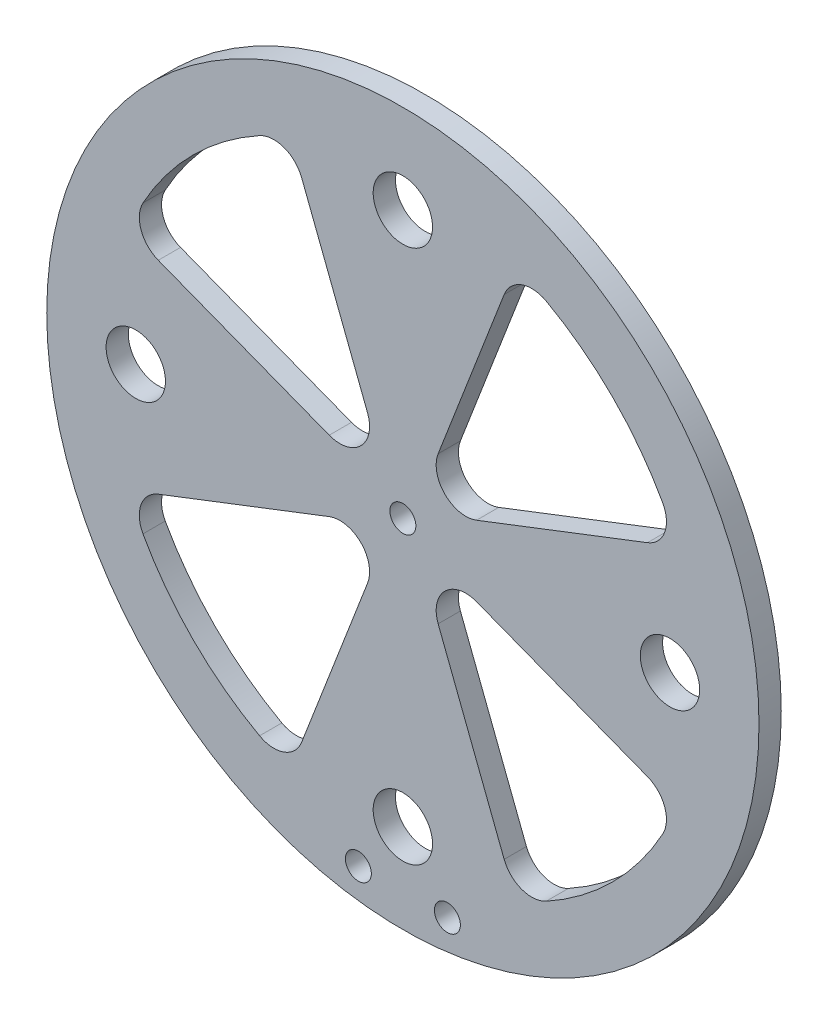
ISO-10303-21;
HEADER;
FILE_DESCRIPTION(('STEP AP214'),'2;1');
FILE_NAME('part.step','',(''),(''),'','','');
FILE_SCHEMA(('AUTOMOTIVE_DESIGN { 1 0 10303 214 1 1 1 1 }'));
ENDSEC;
DATA;
#1=APPLICATION_CONTEXT('core data for automotive mechanical design processes');
#2=APPLICATION_PROTOCOL_DEFINITION('international standard','automotive_design',2000,#1);
#3=PRODUCT_CONTEXT('',#1,'mechanical');
#4=PRODUCT('Part','Part','',(#3));
#5=PRODUCT_RELATED_PRODUCT_CATEGORY('part','',(#4));
#6=PRODUCT_DEFINITION_FORMATION('','',#4);
#7=PRODUCT_DEFINITION_CONTEXT('part definition',#1,'design');
#8=PRODUCT_DEFINITION('design','',#6,#7);
#9=PRODUCT_DEFINITION_SHAPE('','',#8);
#10=(LENGTH_UNIT() NAMED_UNIT(*) SI_UNIT(.MILLI.,.METRE.));
#11=(NAMED_UNIT(*) PLANE_ANGLE_UNIT() SI_UNIT($,.RADIAN.));
#12=(NAMED_UNIT(*) SI_UNIT($,.STERADIAN.) SOLID_ANGLE_UNIT());
#13=UNCERTAINTY_MEASURE_WITH_UNIT(LENGTH_MEASURE(1.E-05),#10,'distance_accuracy_value','');
#14=(GEOMETRIC_REPRESENTATION_CONTEXT(3) GLOBAL_UNCERTAINTY_ASSIGNED_CONTEXT((#13)) GLOBAL_UNIT_ASSIGNED_CONTEXT((#10,
#11,#12)) REPRESENTATION_CONTEXT('',''));
#15=CARTESIAN_POINT('',(0.,0.,0.));
#16=DIRECTION('',(0.,0.,1.));
#17=DIRECTION('',(1.,0.,0.));
#18=AXIS2_PLACEMENT_3D('',#15,#16,#17);
#19=CARTESIAN_POINT('',(0.,0.,3.));
#20=DIRECTION('',(0.,0.,1.));
#21=DIRECTION('',(1.,0.,0.));
#22=AXIS2_PLACEMENT_3D('',#19,#20,#21);
#23=PLANE('',#22);
#24=CARTESIAN_POINT('',(6.,-43.5889894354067,3.));
#25=DIRECTION('',(0.,0.,1.));
#26=DIRECTION('',(1.,0.,0.));
#27=AXIS2_PLACEMENT_3D('',#24,#25,#26);
#28=CIRCLE('',#27,1.75);
#29=CARTESIAN_POINT('',(7.75,-43.5889894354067,3.));
#30=VERTEX_POINT('',#29);
#31=EDGE_CURVE('E236',#30,#30,#28,.T.);
#32=ORIENTED_EDGE('',*,*,#31,.F.);
#33=EDGE_LOOP('',(#32));
#34=FACE_BOUND('',#33,.T.);
#35=CARTESIAN_POINT('',(-17.3829707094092,-31.5251063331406,3.));
#36=DIRECTION('',(0.,0.,1.));
#37=DIRECTION('',(1.,0.,0.));
#38=AXIS2_PLACEMENT_3D('',#35,#36,#37);
#39=CIRCLE('',#38,3.99999999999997);
#40=CARTESIAN_POINT('',(-19.3144118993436,-35.0278959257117,3.));
#41=VERTEX_POINT('',#40);
#42=CARTESIAN_POINT('',(-13.6515570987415,-32.966131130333,3.));
#43=VERTEX_POINT('',#42);
#44=EDGE_CURVE('E258',#41,#43,#39,.T.);
#45=ORIENTED_EDGE('',*,*,#44,.F.);
#46=CARTESIAN_POINT('',(0.,0.,3.));
#47=DIRECTION('',(0.,0.,1.));
#48=DIRECTION('',(1.,0.,0.));
#49=AXIS2_PLACEMENT_3D('',#46,#47,#48);
#50=CIRCLE('',#49,40.);
#51=CARTESIAN_POINT('',(-35.0278959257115,-19.3144118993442,3.));
#52=VERTEX_POINT('',#51);
#53=EDGE_CURVE('E256',#52,#41,#50,.T.);
#54=ORIENTED_EDGE('',*,*,#53,.F.);
#55=CARTESIAN_POINT('',(-31.5251063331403,-17.3829707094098,3.));
#56=DIRECTION('',(0.,0.,1.));
#57=DIRECTION('',(1.,0.,0.));
#58=AXIS2_PLACEMENT_3D('',#55,#56,#57);
#59=CIRCLE('',#58,4.00000000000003);
#60=CARTESIAN_POINT('',(-32.9661311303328,-13.651557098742,3.));
#61=VERTEX_POINT('',#60);
#62=EDGE_CURVE('E268',#61,#52,#59,.T.);
#63=ORIENTED_EDGE('',*,*,#62,.F.);
#64=DIRECTION('',(-0.932853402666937,-0.360256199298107,0.));
#65=VECTOR('',#64,1.);
#66=CARTESIAN_POINT('',(-9.92630617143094,-4.75386776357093,3.));
#67=LINE('',#66,#65);
#68=CARTESIAN_POINT('',(-9.92630617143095,-4.7538677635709,3.));
#69=VERTEX_POINT('',#68);
#70=EDGE_CURVE('E265',#69,#61,#67,.T.);
#71=ORIENTED_EDGE('',*,*,#70,.F.);
#72=CARTESIAN_POINT('',(-8.48528137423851,-8.48528137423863,3.));
#73=DIRECTION('',(0.,0.,1.));
#74=DIRECTION('',(1.,0.,0.));
#75=AXIS2_PLACEMENT_3D('',#72,#73,#74);
#76=CIRCLE('',#75,3.99999999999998);
#77=CARTESIAN_POINT('',(-4.75386776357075,-9.92630617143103,3.));
#78=VERTEX_POINT('',#77);
#79=EDGE_CURVE('E263',#78,#69,#76,.T.);
#80=ORIENTED_EDGE('',*,*,#79,.F.);
#81=DIRECTION('',(0.360256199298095,0.932853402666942,0.));
#82=VECTOR('',#81,1.);
#83=CARTESIAN_POINT('',(-4.75386776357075,-9.92630617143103,3.));
#84=LINE('',#83,#82);
#85=EDGE_CURVE('E261',#43,#78,#84,.T.);
#86=ORIENTED_EDGE('',*,*,#85,.F.);
#87=EDGE_LOOP('',(#45,#54,#63,#71,#80,#86));
#88=FACE_BOUND('',#87,.T.);
#89=CARTESIAN_POINT('',(17.3829707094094,31.5251063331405,3.));
#90=DIRECTION('',(0.,0.,1.));
#91=DIRECTION('',(1.,0.,0.));
#92=AXIS2_PLACEMENT_3D('',#89,#90,#91);
#93=CIRCLE('',#92,3.99999999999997);
#94=CARTESIAN_POINT('',(19.3144118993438,35.0278959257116,3.));
#95=VERTEX_POINT('',#94);
#96=CARTESIAN_POINT('',(13.6515570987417,32.9661311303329,3.));
#97=VERTEX_POINT('',#96);
#98=EDGE_CURVE('E348',#95,#97,#93,.T.);
#99=ORIENTED_EDGE('',*,*,#98,.F.);
#100=CARTESIAN_POINT('',(0.,0.,3.));
#101=DIRECTION('',(0.,0.,1.));
#102=DIRECTION('',(1.,0.,0.));
#103=AXIS2_PLACEMENT_3D('',#100,#101,#102);
#104=CIRCLE('',#103,40.);
#105=CARTESIAN_POINT('',(35.0278959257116,19.314411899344,3.));
#106=VERTEX_POINT('',#105);
#107=EDGE_CURVE('E346',#106,#95,#104,.T.);
#108=ORIENTED_EDGE('',*,*,#107,.F.);
#109=CARTESIAN_POINT('',(31.5251063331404,17.3829707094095,3.));
#110=DIRECTION('',(0.,0.,1.));
#111=DIRECTION('',(1.,0.,0.));
#112=AXIS2_PLACEMENT_3D('',#109,#110,#111);
#113=CIRCLE('',#112,4.00000000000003);
#114=CARTESIAN_POINT('',(32.9661311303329,13.6515570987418,3.));
#115=VERTEX_POINT('',#114);
#116=EDGE_CURVE('E358',#115,#106,#113,.T.);
#117=ORIENTED_EDGE('',*,*,#116,.F.);
#118=DIRECTION('',(0.93285340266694,0.3602561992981,0.));
#119=VECTOR('',#118,1.);
#120=CARTESIAN_POINT('',(9.92630617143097,4.75386776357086,3.));
#121=LINE('',#120,#119);
#122=CARTESIAN_POINT('',(9.92630617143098,4.75386776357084,3.));
#123=VERTEX_POINT('',#122);
#124=EDGE_CURVE('E355',#123,#115,#121,.T.);
#125=ORIENTED_EDGE('',*,*,#124,.F.);
#126=CARTESIAN_POINT('',(8.48528137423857,8.48528137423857,3.));
#127=DIRECTION('',(0.,0.,1.));
#128=DIRECTION('',(1.,0.,0.));
#129=AXIS2_PLACEMENT_3D('',#126,#127,#128);
#130=CIRCLE('',#129,3.99999999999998);
#131=CARTESIAN_POINT('',(4.75386776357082,9.92630617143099,3.));
#132=VERTEX_POINT('',#131);
#133=EDGE_CURVE('E353',#132,#123,#130,.T.);
#134=ORIENTED_EDGE('',*,*,#133,.F.);
#135=DIRECTION('',(-0.360256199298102,-0.932853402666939,0.));
#136=VECTOR('',#135,1.);
#137=CARTESIAN_POINT('',(4.75386776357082,9.92630617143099,3.));
#138=LINE('',#137,#136);
#139=EDGE_CURVE('E351',#97,#132,#138,.T.);
#140=ORIENTED_EDGE('',*,*,#139,.F.);
#141=EDGE_LOOP('',(#99,#108,#117,#125,#134,#140));
#142=FACE_BOUND('',#141,.T.);
#143=CARTESIAN_POINT('',(-36.,3.77080202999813E-13,3.));
#144=DIRECTION('',(0.,0.,1.));
#145=DIRECTION('',(1.,0.,0.));
#146=AXIS2_PLACEMENT_3D('',#143,#144,#145);
#147=CIRCLE('',#146,4.);
#148=CARTESIAN_POINT('',(-32.,3.77080202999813E-13,3.));
#149=VERTEX_POINT('',#148);
#150=EDGE_CURVE('E397',#149,#149,#147,.T.);
#151=ORIENTED_EDGE('',*,*,#150,.F.);
#152=EDGE_LOOP('',(#151));
#153=FACE_BOUND('',#152,.T.);
#154=CARTESIAN_POINT('',(36.,-1.25693400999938E-13,3.));
#155=DIRECTION('',(0.,0.,1.));
#156=DIRECTION('',(1.,0.,0.));
#157=AXIS2_PLACEMENT_3D('',#154,#155,#156);
#158=CIRCLE('',#157,4.);
#159=CARTESIAN_POINT('',(40.,-1.25693400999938E-13,3.));
#160=VERTEX_POINT('',#159);
#161=EDGE_CURVE('E409',#160,#160,#158,.T.);
#162=ORIENTED_EDGE('',*,*,#161,.F.);
#163=EDGE_LOOP('',(#162));
#164=FACE_BOUND('',#163,.T.);
#165=CARTESIAN_POINT('',(0.,0.,3.));
#166=DIRECTION('',(0.,0.,1.));
#167=DIRECTION('',(1.,0.,0.));
#168=AXIS2_PLACEMENT_3D('',#165,#166,#167);
#169=CIRCLE('',#168,48.);
#170=CARTESIAN_POINT('',(48.,0.,3.));
#171=VERTEX_POINT('',#170);
#172=EDGE_CURVE('E13',#171,#171,#169,.T.);
#173=ORIENTED_EDGE('',*,*,#172,.T.);
#174=EDGE_LOOP('',(#173));
#175=FACE_BOUND('',#174,.T.);
#176=CARTESIAN_POINT('',(0.,36.,3.));
#177=DIRECTION('',(0.,0.,1.));
#178=DIRECTION('',(1.,0.,0.));
#179=AXIS2_PLACEMENT_3D('',#176,#177,#178);
#180=CIRCLE('',#179,4.);
#181=CARTESIAN_POINT('',(4.,36.,3.));
#182=VERTEX_POINT('',#181);
#183=EDGE_CURVE('E415',#182,#182,#180,.T.);
#184=ORIENTED_EDGE('',*,*,#183,.F.);
#185=EDGE_LOOP('',(#184));
#186=FACE_BOUND('',#185,.T.);
#187=CARTESIAN_POINT('',(-2.51386801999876E-13,-36.,3.));
#188=DIRECTION('',(0.,0.,1.));
#189=DIRECTION('',(1.,0.,0.));
#190=AXIS2_PLACEMENT_3D('',#187,#188,#189);
#191=CIRCLE('',#190,4.);
#192=CARTESIAN_POINT('',(3.99999999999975,-36.,3.));
#193=VERTEX_POINT('',#192);
#194=EDGE_CURVE('E403',#193,#193,#191,.T.);
#195=ORIENTED_EDGE('',*,*,#194,.F.);
#196=EDGE_LOOP('',(#195));
#197=FACE_BOUND('',#196,.T.);
#198=CARTESIAN_POINT('',(0.,0.,3.));
#199=DIRECTION('',(0.,0.,1.));
#200=DIRECTION('',(1.,0.,0.));
#201=AXIS2_PLACEMENT_3D('',#198,#199,#200);
#202=CIRCLE('',#201,1.75);
#203=CARTESIAN_POINT('',(1.75,0.,3.));
#204=VERTEX_POINT('',#203);
#205=EDGE_CURVE('E391',#204,#204,#202,.T.);
#206=ORIENTED_EDGE('',*,*,#205,.F.);
#207=EDGE_LOOP('',(#206));
#208=FACE_BOUND('',#207,.T.);
#209=CARTESIAN_POINT('',(-31.5251063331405,17.3829707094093,3.));
#210=DIRECTION('',(0.,0.,1.));
#211=DIRECTION('',(1.,0.,0.));
#212=AXIS2_PLACEMENT_3D('',#209,#210,#211);
#213=CIRCLE('',#212,3.99999999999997);
#214=CARTESIAN_POINT('',(-35.0278959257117,19.3144118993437,3.));
#215=VERTEX_POINT('',#214);
#216=CARTESIAN_POINT('',(-32.9661311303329,13.6515570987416,3.));
#217=VERTEX_POINT('',#216);
#218=EDGE_CURVE('E303',#215,#217,#213,.T.);
#219=ORIENTED_EDGE('',*,*,#218,.F.);
#220=CARTESIAN_POINT('',(0.,0.,3.));
#221=DIRECTION('',(0.,0.,1.));
#222=DIRECTION('',(1.,0.,0.));
#223=AXIS2_PLACEMENT_3D('',#220,#221,#222);
#224=CIRCLE('',#223,40.);
#225=CARTESIAN_POINT('',(-19.3144118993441,35.0278959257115,3.));
#226=VERTEX_POINT('',#225);
#227=EDGE_CURVE('E301',#226,#215,#224,.T.);
#228=ORIENTED_EDGE('',*,*,#227,.F.);
#229=CARTESIAN_POINT('',(-17.3829707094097,31.5251063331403,3.));
#230=DIRECTION('',(0.,0.,1.));
#231=DIRECTION('',(1.,0.,0.));
#232=AXIS2_PLACEMENT_3D('',#229,#230,#231);
#233=CIRCLE('',#232,4.00000000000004);
#234=CARTESIAN_POINT('',(-13.6515570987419,32.9661311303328,3.));
#235=VERTEX_POINT('',#234);
#236=EDGE_CURVE('E313',#235,#226,#233,.T.);
#237=ORIENTED_EDGE('',*,*,#236,.F.);
#238=DIRECTION('',(-0.360256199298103,0.932853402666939,0.));
#239=VECTOR('',#238,1.);
#240=CARTESIAN_POINT('',(-4.75386776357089,9.92630617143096,3.));
#241=LINE('',#240,#239);
#242=CARTESIAN_POINT('',(-4.75386776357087,9.92630617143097,3.));
#243=VERTEX_POINT('',#242);
#244=EDGE_CURVE('E310',#243,#235,#241,.T.);
#245=ORIENTED_EDGE('',*,*,#244,.F.);
#246=CARTESIAN_POINT('',(-8.4852813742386,8.48528137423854,3.));
#247=DIRECTION('',(0.,0.,1.));
#248=DIRECTION('',(1.,0.,0.));
#249=AXIS2_PLACEMENT_3D('',#246,#247,#248);
#250=CIRCLE('',#249,3.99999999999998);
#251=CARTESIAN_POINT('',(-9.92630617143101,4.75386776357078,3.));
#252=VERTEX_POINT('',#251);
#253=EDGE_CURVE('E308',#252,#243,#250,.T.);
#254=ORIENTED_EDGE('',*,*,#253,.F.);
#255=DIRECTION('',(0.93285340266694,-0.360256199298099,0.));
#256=VECTOR('',#255,1.);
#257=CARTESIAN_POINT('',(-9.92630617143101,4.75386776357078,3.));
#258=LINE('',#257,#256);
#259=EDGE_CURVE('E306',#217,#252,#258,.T.);
#260=ORIENTED_EDGE('',*,*,#259,.F.);
#261=EDGE_LOOP('',(#219,#228,#237,#245,#254,#260));
#262=FACE_BOUND('',#261,.T.);
#263=CARTESIAN_POINT('',(31.5251063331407,-17.3829707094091,3.));
#264=DIRECTION('',(0.,0.,1.));
#265=DIRECTION('',(1.,0.,0.));
#266=AXIS2_PLACEMENT_3D('',#263,#264,#265);
#267=CIRCLE('',#266,3.99999999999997);
#268=CARTESIAN_POINT('',(35.0278959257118,-19.3144118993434,3.));
#269=VERTEX_POINT('',#268);
#270=CARTESIAN_POINT('',(32.966131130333,-13.6515570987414,3.));
#271=VERTEX_POINT('',#270);
#272=EDGE_CURVE('E210',#269,#271,#267,.T.);
#273=ORIENTED_EDGE('',*,*,#272,.F.);
#274=CARTESIAN_POINT('',(0.,0.,3.));
#275=DIRECTION('',(0.,0.,1.));
#276=DIRECTION('',(1.,0.,0.));
#277=AXIS2_PLACEMENT_3D('',#274,#275,#276);
#278=CIRCLE('',#277,40.);
#279=CARTESIAN_POINT('',(19.3144118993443,-35.0278959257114,3.));
#280=VERTEX_POINT('',#279);
#281=EDGE_CURVE('E202',#280,#269,#278,.T.);
#282=ORIENTED_EDGE('',*,*,#281,.F.);
#283=CARTESIAN_POINT('',(17.3829707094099,-31.5251063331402,3.));
#284=DIRECTION('',(0.,0.,1.));
#285=DIRECTION('',(1.,0.,0.));
#286=AXIS2_PLACEMENT_3D('',#283,#284,#285);
#287=CIRCLE('',#286,4.00000000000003);
#288=CARTESIAN_POINT('',(13.6515570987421,-32.9661311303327,3.));
#289=VERTEX_POINT('',#288);
#290=EDGE_CURVE('E233',#289,#280,#287,.T.);
#291=ORIENTED_EDGE('',*,*,#290,.F.);
#292=DIRECTION('',(0.36025619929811,-0.932853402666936,0.));
#293=VECTOR('',#292,1.);
#294=CARTESIAN_POINT('',(4.75386776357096,-9.92630617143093,3.));
#295=LINE('',#294,#293);
#296=CARTESIAN_POINT('',(4.75386776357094,-9.92630617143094,3.));
#297=VERTEX_POINT('',#296);
#298=EDGE_CURVE('E231',#297,#289,#295,.T.);
#299=ORIENTED_EDGE('',*,*,#298,.F.);
#300=CARTESIAN_POINT('',(8.48528137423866,-8.48528137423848,3.));
#301=DIRECTION('',(0.,0.,1.));
#302=DIRECTION('',(1.,0.,0.));
#303=AXIS2_PLACEMENT_3D('',#300,#301,#302);
#304=CIRCLE('',#303,3.99999999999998);
#305=CARTESIAN_POINT('',(9.92630617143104,-4.75386776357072,3.));
#306=VERTEX_POINT('',#305);
#307=EDGE_CURVE('E226',#306,#297,#304,.T.);
#308=ORIENTED_EDGE('',*,*,#307,.F.);
#309=DIRECTION('',(-0.932853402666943,0.360256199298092,0.));
#310=VECTOR('',#309,1.);
#311=CARTESIAN_POINT('',(9.92630617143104,-4.75386776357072,3.));
#312=LINE('',#311,#310);
#313=EDGE_CURVE('E224',#271,#306,#312,.T.);
#314=ORIENTED_EDGE('',*,*,#313,.F.);
#315=EDGE_LOOP('',(#273,#282,#291,#299,#308,#314));
#316=FACE_BOUND('',#315,.T.);
#317=CARTESIAN_POINT('',(-6.,-43.5889894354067,3.));
#318=DIRECTION('',(0.,0.,1.));
#319=DIRECTION('',(1.,0.,0.));
#320=AXIS2_PLACEMENT_3D('',#317,#318,#319);
#321=CIRCLE('',#320,1.75);
#322=CARTESIAN_POINT('',(-4.25,-43.5889894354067,3.));
#323=VERTEX_POINT('',#322);
#324=EDGE_CURVE('E756',#323,#323,#321,.T.);
#325=ORIENTED_EDGE('',*,*,#324,.F.);
#326=EDGE_LOOP('',(#325));
#327=FACE_BOUND('',#326,.T.);
#328=ADVANCED_FACE('F41',(#34,#88,#142,#153,#164,#175,#186,#197,#208,#262,#316,#327),#23,.T.);
#329=CARTESIAN_POINT('',(0.,0.,0.));
#330=DIRECTION('',(0.,0.,1.));
#331=DIRECTION('',(1.,0.,0.));
#332=AXIS2_PLACEMENT_3D('',#329,#330,#331);
#333=PLANE('',#332);
#334=CARTESIAN_POINT('',(6.,-43.5889894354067,0.));
#335=DIRECTION('',(0.,0.,1.));
#336=DIRECTION('',(1.,0.,0.));
#337=AXIS2_PLACEMENT_3D('',#334,#335,#336);
#338=CIRCLE('',#337,1.75);
#339=CARTESIAN_POINT('',(7.75,-43.5889894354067,0.));
#340=VERTEX_POINT('',#339);
#341=EDGE_CURVE('E762',#340,#340,#338,.T.);
#342=ORIENTED_EDGE('',*,*,#341,.T.);
#343=EDGE_LOOP('',(#342));
#344=FACE_BOUND('',#343,.T.);
#345=CARTESIAN_POINT('',(0.,0.,0.));
#346=DIRECTION('',(0.,0.,1.));
#347=DIRECTION('',(1.,0.,0.));
#348=AXIS2_PLACEMENT_3D('',#345,#346,#347);
#349=CIRCLE('',#348,40.);
#350=CARTESIAN_POINT('',(-35.0278959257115,-19.3144118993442,0.));
#351=VERTEX_POINT('',#350);
#352=CARTESIAN_POINT('',(-19.3144118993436,-35.0278959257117,0.));
#353=VERTEX_POINT('',#352);
#354=EDGE_CURVE('E218',#351,#353,#349,.T.);
#355=ORIENTED_EDGE('',*,*,#354,.T.);
#356=CARTESIAN_POINT('',(-17.3829707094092,-31.5251063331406,0.));
#357=DIRECTION('',(0.,0.,1.));
#358=DIRECTION('',(1.,0.,0.));
#359=AXIS2_PLACEMENT_3D('',#356,#357,#358);
#360=CIRCLE('',#359,3.99999999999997);
#361=CARTESIAN_POINT('',(-13.6515570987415,-32.966131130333,0.));
#362=VERTEX_POINT('',#361);
#363=EDGE_CURVE('E273',#353,#362,#360,.T.);
#364=ORIENTED_EDGE('',*,*,#363,.T.);
#365=DIRECTION('',(0.360256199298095,0.932853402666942,0.));
#366=VECTOR('',#365,1.);
#367=CARTESIAN_POINT('',(-4.75386776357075,-9.92630617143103,0.));
#368=LINE('',#367,#366);
#369=CARTESIAN_POINT('',(-4.75386776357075,-9.92630617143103,0.));
#370=VERTEX_POINT('',#369);
#371=EDGE_CURVE('E276',#362,#370,#368,.T.);
#372=ORIENTED_EDGE('',*,*,#371,.T.);
#373=CARTESIAN_POINT('',(-8.48528137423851,-8.48528137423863,0.));
#374=DIRECTION('',(0.,0.,1.));
#375=DIRECTION('',(1.,0.,0.));
#376=AXIS2_PLACEMENT_3D('',#373,#374,#375);
#377=CIRCLE('',#376,3.99999999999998);
#378=CARTESIAN_POINT('',(-9.92630617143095,-4.7538677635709,0.));
#379=VERTEX_POINT('',#378);
#380=EDGE_CURVE('E279',#370,#379,#377,.T.);
#381=ORIENTED_EDGE('',*,*,#380,.T.);
#382=DIRECTION('',(-0.932853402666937,-0.360256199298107,0.));
#383=VECTOR('',#382,1.);
#384=CARTESIAN_POINT('',(-9.92630617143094,-4.75386776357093,0.));
#385=LINE('',#384,#383);
#386=CARTESIAN_POINT('',(-32.9661311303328,-13.651557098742,0.));
#387=VERTEX_POINT('',#386);
#388=EDGE_CURVE('E282',#379,#387,#385,.T.);
#389=ORIENTED_EDGE('',*,*,#388,.T.);
#390=CARTESIAN_POINT('',(-31.5251063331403,-17.3829707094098,0.));
#391=DIRECTION('',(0.,0.,1.));
#392=DIRECTION('',(1.,0.,0.));
#393=AXIS2_PLACEMENT_3D('',#390,#391,#392);
#394=CIRCLE('',#393,4.00000000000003);
#395=EDGE_CURVE('E259',#387,#351,#394,.T.);
#396=ORIENTED_EDGE('',*,*,#395,.T.);
#397=EDGE_LOOP('',(#355,#364,#372,#381,#389,#396));
#398=FACE_BOUND('',#397,.T.);
#399=CARTESIAN_POINT('',(0.,0.,0.));
#400=DIRECTION('',(0.,0.,1.));
#401=DIRECTION('',(1.,0.,0.));
#402=AXIS2_PLACEMENT_3D('',#399,#400,#401);
#403=CIRCLE('',#402,40.);
#404=CARTESIAN_POINT('',(35.0278959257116,19.314411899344,0.));
#405=VERTEX_POINT('',#404);
#406=CARTESIAN_POINT('',(19.3144118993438,35.0278959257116,0.));
#407=VERTEX_POINT('',#406);
#408=EDGE_CURVE('E345',#405,#407,#403,.T.);
#409=ORIENTED_EDGE('',*,*,#408,.T.);
#410=CARTESIAN_POINT('',(17.3829707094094,31.5251063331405,0.));
#411=DIRECTION('',(0.,0.,1.));
#412=DIRECTION('',(1.,0.,0.));
#413=AXIS2_PLACEMENT_3D('',#410,#411,#412);
#414=CIRCLE('',#413,3.99999999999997);
#415=CARTESIAN_POINT('',(13.6515570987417,32.9661311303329,0.));
#416=VERTEX_POINT('',#415);
#417=EDGE_CURVE('E363',#407,#416,#414,.T.);
#418=ORIENTED_EDGE('',*,*,#417,.T.);
#419=DIRECTION('',(-0.360256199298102,-0.932853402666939,0.));
#420=VECTOR('',#419,1.);
#421=CARTESIAN_POINT('',(4.75386776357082,9.92630617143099,0.));
#422=LINE('',#421,#420);
#423=CARTESIAN_POINT('',(4.75386776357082,9.92630617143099,0.));
#424=VERTEX_POINT('',#423);
#425=EDGE_CURVE('E366',#416,#424,#422,.T.);
#426=ORIENTED_EDGE('',*,*,#425,.T.);
#427=CARTESIAN_POINT('',(8.48528137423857,8.48528137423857,0.));
#428=DIRECTION('',(0.,0.,1.));
#429=DIRECTION('',(1.,0.,0.));
#430=AXIS2_PLACEMENT_3D('',#427,#428,#429);
#431=CIRCLE('',#430,3.99999999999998);
#432=CARTESIAN_POINT('',(9.92630617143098,4.75386776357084,0.));
#433=VERTEX_POINT('',#432);
#434=EDGE_CURVE('E369',#424,#433,#431,.T.);
#435=ORIENTED_EDGE('',*,*,#434,.T.);
#436=DIRECTION('',(0.93285340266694,0.3602561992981,0.));
#437=VECTOR('',#436,1.);
#438=CARTESIAN_POINT('',(9.92630617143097,4.75386776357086,0.));
#439=LINE('',#438,#437);
#440=CARTESIAN_POINT('',(32.9661311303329,13.6515570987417,0.));
#441=VERTEX_POINT('',#440);
#442=EDGE_CURVE('E372',#433,#441,#439,.T.);
#443=ORIENTED_EDGE('',*,*,#442,.T.);
#444=CARTESIAN_POINT('',(31.5251063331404,17.3829707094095,0.));
#445=DIRECTION('',(0.,0.,1.));
#446=DIRECTION('',(1.,0.,0.));
#447=AXIS2_PLACEMENT_3D('',#444,#445,#446);
#448=CIRCLE('',#447,4.00000000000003);
#449=EDGE_CURVE('E349',#441,#405,#448,.T.);
#450=ORIENTED_EDGE('',*,*,#449,.T.);
#451=EDGE_LOOP('',(#409,#418,#426,#435,#443,#450));
#452=FACE_BOUND('',#451,.T.);
#453=CARTESIAN_POINT('',(-36.,3.77080202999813E-13,0.));
#454=DIRECTION('',(0.,0.,1.));
#455=DIRECTION('',(1.,0.,0.));
#456=AXIS2_PLACEMENT_3D('',#453,#454,#455);
#457=CIRCLE('',#456,4.);
#458=CARTESIAN_POINT('',(-32.,3.77080202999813E-13,0.));
#459=VERTEX_POINT('',#458);
#460=EDGE_CURVE('E394',#459,#459,#457,.T.);
#461=ORIENTED_EDGE('',*,*,#460,.T.);
#462=EDGE_LOOP('',(#461));
#463=FACE_BOUND('',#462,.T.);
#464=CARTESIAN_POINT('',(36.,-1.25693400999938E-13,0.));
#465=DIRECTION('',(0.,0.,1.));
#466=DIRECTION('',(1.,0.,0.));
#467=AXIS2_PLACEMENT_3D('',#464,#465,#466);
#468=CIRCLE('',#467,4.);
#469=CARTESIAN_POINT('',(40.,-1.25693400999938E-13,0.));
#470=VERTEX_POINT('',#469);
#471=EDGE_CURVE('E406',#470,#470,#468,.T.);
#472=ORIENTED_EDGE('',*,*,#471,.T.);
#473=EDGE_LOOP('',(#472));
#474=FACE_BOUND('',#473,.T.);
#475=CARTESIAN_POINT('',(0.,0.,0.));
#476=DIRECTION('',(0.,0.,1.));
#477=DIRECTION('',(1.,0.,0.));
#478=AXIS2_PLACEMENT_3D('',#475,#476,#477);
#479=CIRCLE('',#478,48.);
#480=CARTESIAN_POINT('',(48.,0.,0.));
#481=VERTEX_POINT('',#480);
#482=EDGE_CURVE('E45',#481,#481,#479,.T.);
#483=ORIENTED_EDGE('',*,*,#482,.F.);
#484=EDGE_LOOP('',(#483));
#485=FACE_BOUND('',#484,.T.);
#486=CARTESIAN_POINT('',(0.,36.,0.));
#487=DIRECTION('',(0.,0.,1.));
#488=DIRECTION('',(1.,0.,0.));
#489=AXIS2_PLACEMENT_3D('',#486,#487,#488);
#490=CIRCLE('',#489,4.);
#491=CARTESIAN_POINT('',(4.,36.,0.));
#492=VERTEX_POINT('',#491);
#493=EDGE_CURVE('E412',#492,#492,#490,.T.);
#494=ORIENTED_EDGE('',*,*,#493,.T.);
#495=EDGE_LOOP('',(#494));
#496=FACE_BOUND('',#495,.T.);
#497=CARTESIAN_POINT('',(-2.51386801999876E-13,-36.,0.));
#498=DIRECTION('',(0.,0.,1.));
#499=DIRECTION('',(1.,0.,0.));
#500=AXIS2_PLACEMENT_3D('',#497,#498,#499);
#501=CIRCLE('',#500,4.);
#502=CARTESIAN_POINT('',(3.99999999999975,-36.,0.));
#503=VERTEX_POINT('',#502);
#504=EDGE_CURVE('E400',#503,#503,#501,.T.);
#505=ORIENTED_EDGE('',*,*,#504,.T.);
#506=EDGE_LOOP('',(#505));
#507=FACE_BOUND('',#506,.T.);
#508=CARTESIAN_POINT('',(0.,0.,0.));
#509=DIRECTION('',(0.,0.,1.));
#510=DIRECTION('',(1.,0.,0.));
#511=AXIS2_PLACEMENT_3D('',#508,#509,#510);
#512=CIRCLE('',#511,1.75);
#513=CARTESIAN_POINT('',(1.75,0.,0.));
#514=VERTEX_POINT('',#513);
#515=EDGE_CURVE('E390',#514,#514,#512,.T.);
#516=ORIENTED_EDGE('',*,*,#515,.T.);
#517=EDGE_LOOP('',(#516));
#518=FACE_BOUND('',#517,.T.);
#519=CARTESIAN_POINT('',(0.,0.,0.));
#520=DIRECTION('',(0.,0.,1.));
#521=DIRECTION('',(1.,0.,0.));
#522=AXIS2_PLACEMENT_3D('',#519,#520,#521);
#523=CIRCLE('',#522,40.);
#524=CARTESIAN_POINT('',(-19.3144118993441,35.0278959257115,0.));
#525=VERTEX_POINT('',#524);
#526=CARTESIAN_POINT('',(-35.0278959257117,19.3144118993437,0.));
#527=VERTEX_POINT('',#526);
#528=EDGE_CURVE('E300',#525,#527,#523,.T.);
#529=ORIENTED_EDGE('',*,*,#528,.T.);
#530=CARTESIAN_POINT('',(-31.5251063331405,17.3829707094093,0.));
#531=DIRECTION('',(0.,0.,1.));
#532=DIRECTION('',(1.,0.,0.));
#533=AXIS2_PLACEMENT_3D('',#530,#531,#532);
#534=CIRCLE('',#533,3.99999999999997);
#535=CARTESIAN_POINT('',(-32.9661311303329,13.6515570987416,0.));
#536=VERTEX_POINT('',#535);
#537=EDGE_CURVE('E318',#527,#536,#534,.T.);
#538=ORIENTED_EDGE('',*,*,#537,.T.);
#539=DIRECTION('',(0.93285340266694,-0.360256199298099,0.));
#540=VECTOR('',#539,1.);
#541=CARTESIAN_POINT('',(-9.92630617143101,4.75386776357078,0.));
#542=LINE('',#541,#540);
#543=CARTESIAN_POINT('',(-9.92630617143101,4.75386776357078,0.));
#544=VERTEX_POINT('',#543);
#545=EDGE_CURVE('E321',#536,#544,#542,.T.);
#546=ORIENTED_EDGE('',*,*,#545,.T.);
#547=CARTESIAN_POINT('',(-8.4852813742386,8.48528137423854,0.));
#548=DIRECTION('',(0.,0.,1.));
#549=DIRECTION('',(1.,0.,0.));
#550=AXIS2_PLACEMENT_3D('',#547,#548,#549);
#551=CIRCLE('',#550,3.99999999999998);
#552=CARTESIAN_POINT('',(-4.75386776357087,9.92630617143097,0.));
#553=VERTEX_POINT('',#552);
#554=EDGE_CURVE('E324',#544,#553,#551,.T.);
#555=ORIENTED_EDGE('',*,*,#554,.T.);
#556=DIRECTION('',(-0.360256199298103,0.932853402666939,0.));
#557=VECTOR('',#556,1.);
#558=CARTESIAN_POINT('',(-4.75386776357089,9.92630617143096,0.));
#559=LINE('',#558,#557);
#560=CARTESIAN_POINT('',(-13.6515570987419,32.9661311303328,0.));
#561=VERTEX_POINT('',#560);
#562=EDGE_CURVE('E327',#553,#561,#559,.T.);
#563=ORIENTED_EDGE('',*,*,#562,.T.);
#564=CARTESIAN_POINT('',(-17.3829707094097,31.5251063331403,0.));
#565=DIRECTION('',(0.,0.,1.));
#566=DIRECTION('',(1.,0.,0.));
#567=AXIS2_PLACEMENT_3D('',#564,#565,#566);
#568=CIRCLE('',#567,4.00000000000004);
#569=EDGE_CURVE('E304',#561,#525,#568,.T.);
#570=ORIENTED_EDGE('',*,*,#569,.T.);
#571=EDGE_LOOP('',(#529,#538,#546,#555,#563,#570));
#572=FACE_BOUND('',#571,.T.);
#573=CARTESIAN_POINT('',(0.,0.,0.));
#574=DIRECTION('',(0.,0.,1.));
#575=DIRECTION('',(1.,0.,0.));
#576=AXIS2_PLACEMENT_3D('',#573,#574,#575);
#577=CIRCLE('',#576,40.);
#578=CARTESIAN_POINT('',(19.3144118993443,-35.0278959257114,0.));
#579=VERTEX_POINT('',#578);
#580=CARTESIAN_POINT('',(35.0278959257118,-19.3144118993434,0.));
#581=VERTEX_POINT('',#580);
#582=EDGE_CURVE('E64',#579,#581,#577,.T.);
#583=ORIENTED_EDGE('',*,*,#582,.T.);
#584=CARTESIAN_POINT('',(31.5251063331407,-17.3829707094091,0.));
#585=DIRECTION('',(0.,0.,1.));
#586=DIRECTION('',(1.,0.,0.));
#587=AXIS2_PLACEMENT_3D('',#584,#585,#586);
#588=CIRCLE('',#587,3.99999999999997);
#589=CARTESIAN_POINT('',(32.966131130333,-13.6515570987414,0.));
#590=VERTEX_POINT('',#589);
#591=EDGE_CURVE('E217',#581,#590,#588,.T.);
#592=ORIENTED_EDGE('',*,*,#591,.T.);
#593=DIRECTION('',(-0.932853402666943,0.360256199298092,0.));
#594=VECTOR('',#593,1.);
#595=CARTESIAN_POINT('',(9.92630617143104,-4.75386776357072,0.));
#596=LINE('',#595,#594);
#597=CARTESIAN_POINT('',(9.92630617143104,-4.75386776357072,0.));
#598=VERTEX_POINT('',#597);
#599=EDGE_CURVE('E238',#590,#598,#596,.T.);
#600=ORIENTED_EDGE('',*,*,#599,.T.);
#601=CARTESIAN_POINT('',(8.48528137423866,-8.48528137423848,0.));
#602=DIRECTION('',(0.,0.,1.));
#603=DIRECTION('',(1.,0.,0.));
#604=AXIS2_PLACEMENT_3D('',#601,#602,#603);
#605=CIRCLE('',#604,3.99999999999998);
#606=CARTESIAN_POINT('',(4.75386776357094,-9.92630617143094,0.));
#607=VERTEX_POINT('',#606);
#608=EDGE_CURVE('E241',#598,#607,#605,.T.);
#609=ORIENTED_EDGE('',*,*,#608,.T.);
#610=DIRECTION('',(0.36025619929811,-0.932853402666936,0.));
#611=VECTOR('',#610,1.);
#612=CARTESIAN_POINT('',(4.75386776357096,-9.92630617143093,0.));
#613=LINE('',#612,#611);
#614=CARTESIAN_POINT('',(13.6515570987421,-32.9661311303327,0.));
#615=VERTEX_POINT('',#614);
#616=EDGE_CURVE('E244',#607,#615,#613,.T.);
#617=ORIENTED_EDGE('',*,*,#616,.T.);
#618=CARTESIAN_POINT('',(17.3829707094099,-31.5251063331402,0.));
#619=DIRECTION('',(0.,0.,1.));
#620=DIRECTION('',(1.,0.,0.));
#621=AXIS2_PLACEMENT_3D('',#618,#619,#620);
#622=CIRCLE('',#621,4.00000000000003);
#623=EDGE_CURVE('E211',#615,#579,#622,.T.);
#624=ORIENTED_EDGE('',*,*,#623,.T.);
#625=EDGE_LOOP('',(#583,#592,#600,#609,#617,#624));
#626=FACE_BOUND('',#625,.T.);
#627=CARTESIAN_POINT('',(-6.,-43.5889894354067,0.));
#628=DIRECTION('',(0.,0.,1.));
#629=DIRECTION('',(1.,0.,0.));
#630=AXIS2_PLACEMENT_3D('',#627,#628,#629);
#631=CIRCLE('',#630,1.75);
#632=CARTESIAN_POINT('',(-4.25,-43.5889894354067,0.));
#633=VERTEX_POINT('',#632);
#634=EDGE_CURVE('E759',#633,#633,#631,.T.);
#635=ORIENTED_EDGE('',*,*,#634,.T.);
#636=EDGE_LOOP('',(#635));
#637=FACE_BOUND('',#636,.T.);
#638=ADVANCED_FACE('F421',(#344,#398,#452,#463,#474,#485,#496,#507,#518,#572,#626,#637),#333,.F.);
#639=CARTESIAN_POINT('',(0.,0.,3.));
#640=DIRECTION('',(0.,0.,-1.));
#641=DIRECTION('',(-1.,0.,0.));
#642=AXIS2_PLACEMENT_3D('',#639,#640,#641);
#643=CYLINDRICAL_SURFACE('',#642,48.);
#644=ORIENTED_EDGE('',*,*,#172,.F.);
#645=EDGE_LOOP('',(#644));
#646=FACE_BOUND('',#645,.T.);
#647=ORIENTED_EDGE('',*,*,#482,.T.);
#648=EDGE_LOOP('',(#647));
#649=FACE_BOUND('',#648,.T.);
#650=ADVANCED_FACE('F43',(#646,#649),#643,.T.);
#651=CARTESIAN_POINT('',(0.,36.,3.));
#652=DIRECTION('',(0.,0.,-1.));
#653=DIRECTION('',(-1.,0.,0.));
#654=AXIS2_PLACEMENT_3D('',#651,#652,#653);
#655=CYLINDRICAL_SURFACE('',#654,4.);
#656=ORIENTED_EDGE('',*,*,#183,.T.);
#657=EDGE_LOOP('',(#656));
#658=FACE_BOUND('',#657,.T.);
#659=ORIENTED_EDGE('',*,*,#493,.F.);
#660=EDGE_LOOP('',(#659));
#661=FACE_BOUND('',#660,.T.);
#662=ADVANCED_FACE('F424',(#658,#661),#655,.F.);
#663=CARTESIAN_POINT('',(36.,-1.25693400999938E-13,3.));
#664=DIRECTION('',(0.,0.,-1.));
#665=DIRECTION('',(-1.,0.,0.));
#666=AXIS2_PLACEMENT_3D('',#663,#664,#665);
#667=CYLINDRICAL_SURFACE('',#666,4.);
#668=ORIENTED_EDGE('',*,*,#161,.T.);
#669=EDGE_LOOP('',(#668));
#670=FACE_BOUND('',#669,.T.);
#671=ORIENTED_EDGE('',*,*,#471,.F.);
#672=EDGE_LOOP('',(#671));
#673=FACE_BOUND('',#672,.T.);
#674=ADVANCED_FACE('F426',(#670,#673),#667,.F.);
#675=CARTESIAN_POINT('',(-2.51386801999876E-13,-36.,3.));
#676=DIRECTION('',(0.,0.,-1.));
#677=DIRECTION('',(-1.,0.,0.));
#678=AXIS2_PLACEMENT_3D('',#675,#676,#677);
#679=CYLINDRICAL_SURFACE('',#678,4.);
#680=ORIENTED_EDGE('',*,*,#194,.T.);
#681=EDGE_LOOP('',(#680));
#682=FACE_BOUND('',#681,.T.);
#683=ORIENTED_EDGE('',*,*,#504,.F.);
#684=EDGE_LOOP('',(#683));
#685=FACE_BOUND('',#684,.T.);
#686=ADVANCED_FACE('F433',(#682,#685),#679,.F.);
#687=CARTESIAN_POINT('',(-36.,3.77080202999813E-13,3.));
#688=DIRECTION('',(0.,0.,-1.));
#689=DIRECTION('',(-1.,0.,0.));
#690=AXIS2_PLACEMENT_3D('',#687,#688,#689);
#691=CYLINDRICAL_SURFACE('',#690,4.);
#692=ORIENTED_EDGE('',*,*,#150,.T.);
#693=EDGE_LOOP('',(#692));
#694=FACE_BOUND('',#693,.T.);
#695=ORIENTED_EDGE('',*,*,#460,.F.);
#696=EDGE_LOOP('',(#695));
#697=FACE_BOUND('',#696,.T.);
#698=ADVANCED_FACE('F537',(#694,#697),#691,.F.);
#699=CARTESIAN_POINT('',(0.,0.,3.));
#700=DIRECTION('',(0.,0.,-1.));
#701=DIRECTION('',(-1.,0.,0.));
#702=AXIS2_PLACEMENT_3D('',#699,#700,#701);
#703=CYLINDRICAL_SURFACE('',#702,1.75);
#704=ORIENTED_EDGE('',*,*,#205,.T.);
#705=EDGE_LOOP('',(#704));
#706=FACE_BOUND('',#705,.T.);
#707=ORIENTED_EDGE('',*,*,#515,.F.);
#708=EDGE_LOOP('',(#707));
#709=FACE_BOUND('',#708,.T.);
#710=ADVANCED_FACE('F533',(#706,#709),#703,.F.);
#711=CARTESIAN_POINT('',(0.,0.,3.));
#712=DIRECTION('',(0.,0.,-1.));
#713=DIRECTION('',(-1.,0.,0.));
#714=AXIS2_PLACEMENT_3D('',#711,#712,#713);
#715=CYLINDRICAL_SURFACE('',#714,40.);
#716=ORIENTED_EDGE('',*,*,#408,.F.);
#717=DIRECTION('',(0.,0.,-1.));
#718=VECTOR('',#717,1.);
#719=CARTESIAN_POINT('',(35.0278959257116,19.314411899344,3.));
#720=LINE('',#719,#718);
#721=EDGE_CURVE('E360',#106,#405,#720,.T.);
#722=ORIENTED_EDGE('',*,*,#721,.F.);
#723=ORIENTED_EDGE('',*,*,#107,.T.);
#724=DIRECTION('',(0.,0.,-1.));
#725=VECTOR('',#724,1.);
#726=CARTESIAN_POINT('',(19.3144118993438,35.0278959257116,3.));
#727=LINE('',#726,#725);
#728=EDGE_CURVE('E387',#95,#407,#727,.T.);
#729=ORIENTED_EDGE('',*,*,#728,.T.);
#730=EDGE_LOOP('',(#716,#722,#723,#729));
#731=FACE_BOUND('',#730,.T.);
#732=ADVANCED_FACE('F529',(#731),#715,.F.);
#733=CARTESIAN_POINT('',(17.3829707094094,31.5251063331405,3.));
#734=DIRECTION('',(0.,0.,-1.));
#735=DIRECTION('',(-1.,0.,0.));
#736=AXIS2_PLACEMENT_3D('',#733,#734,#735);
#737=CYLINDRICAL_SURFACE('',#736,3.99999999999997);
#738=ORIENTED_EDGE('',*,*,#417,.F.);
#739=ORIENTED_EDGE('',*,*,#728,.F.);
#740=ORIENTED_EDGE('',*,*,#98,.T.);
#741=DIRECTION('',(0.,0.,-1.));
#742=VECTOR('',#741,1.);
#743=CARTESIAN_POINT('',(13.6515570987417,32.9661311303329,3.));
#744=LINE('',#743,#742);
#745=EDGE_CURVE('E385',#97,#416,#744,.T.);
#746=ORIENTED_EDGE('',*,*,#745,.T.);
#747=EDGE_LOOP('',(#738,#739,#740,#746));
#748=FACE_BOUND('',#747,.T.);
#749=ADVANCED_FACE('F525',(#748),#737,.F.);
#750=CARTESIAN_POINT('',(4.75386776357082,9.92630617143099,3.));
#751=DIRECTION('',(0.932853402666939,-0.360256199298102,0.));
#752=DIRECTION('',(0.360256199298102,0.932853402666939,0.));
#753=AXIS2_PLACEMENT_3D('',#750,#751,#752);
#754=PLANE('',#753);
#755=ORIENTED_EDGE('',*,*,#425,.F.);
#756=ORIENTED_EDGE('',*,*,#745,.F.);
#757=ORIENTED_EDGE('',*,*,#139,.T.);
#758=DIRECTION('',(0.,0.,-1.));
#759=VECTOR('',#758,1.);
#760=CARTESIAN_POINT('',(4.75386776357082,9.92630617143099,3.));
#761=LINE('',#760,#759);
#762=EDGE_CURVE('E383',#132,#424,#761,.T.);
#763=ORIENTED_EDGE('',*,*,#762,.T.);
#764=EDGE_LOOP('',(#755,#756,#757,#763));
#765=FACE_BOUND('',#764,.T.);
#766=ADVANCED_FACE('F521',(#765),#754,.T.);
#767=CARTESIAN_POINT('',(8.48528137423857,8.48528137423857,3.));
#768=DIRECTION('',(0.,0.,-1.));
#769=DIRECTION('',(-1.,0.,0.));
#770=AXIS2_PLACEMENT_3D('',#767,#768,#769);
#771=CYLINDRICAL_SURFACE('',#770,3.99999999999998);
#772=ORIENTED_EDGE('',*,*,#434,.F.);
#773=ORIENTED_EDGE('',*,*,#762,.F.);
#774=ORIENTED_EDGE('',*,*,#133,.T.);
#775=DIRECTION('',(0.,0.,-1.));
#776=VECTOR('',#775,1.);
#777=CARTESIAN_POINT('',(9.92630617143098,4.75386776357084,3.));
#778=LINE('',#777,#776);
#779=EDGE_CURVE('E381',#123,#433,#778,.T.);
#780=ORIENTED_EDGE('',*,*,#779,.T.);
#781=EDGE_LOOP('',(#772,#773,#774,#780));
#782=FACE_BOUND('',#781,.T.);
#783=ADVANCED_FACE('F517',(#782),#771,.F.);
#784=CARTESIAN_POINT('',(9.92630617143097,4.75386776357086,3.));
#785=DIRECTION('',(-0.3602561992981,0.93285340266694,0.));
#786=DIRECTION('',(-0.93285340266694,-0.3602561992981,0.));
#787=AXIS2_PLACEMENT_3D('',#784,#785,#786);
#788=PLANE('',#787);
#789=ORIENTED_EDGE('',*,*,#442,.F.);
#790=ORIENTED_EDGE('',*,*,#779,.F.);
#791=ORIENTED_EDGE('',*,*,#124,.T.);
#792=DIRECTION('',(0.,0.,-1.));
#793=VECTOR('',#792,1.);
#794=CARTESIAN_POINT('',(32.9661311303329,13.6515570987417,3.));
#795=LINE('',#794,#793);
#796=EDGE_CURVE('E379',#115,#441,#795,.T.);
#797=ORIENTED_EDGE('',*,*,#796,.T.);
#798=EDGE_LOOP('',(#789,#790,#791,#797));
#799=FACE_BOUND('',#798,.T.);
#800=ADVANCED_FACE('F513',(#799),#788,.T.);
#801=CARTESIAN_POINT('',(31.5251063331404,17.3829707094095,3.));
#802=DIRECTION('',(0.,0.,-1.));
#803=DIRECTION('',(-1.,0.,0.));
#804=AXIS2_PLACEMENT_3D('',#801,#802,#803);
#805=CYLINDRICAL_SURFACE('',#804,4.00000000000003);
#806=ORIENTED_EDGE('',*,*,#449,.F.);
#807=ORIENTED_EDGE('',*,*,#796,.F.);
#808=ORIENTED_EDGE('',*,*,#116,.T.);
#809=ORIENTED_EDGE('',*,*,#721,.T.);
#810=EDGE_LOOP('',(#806,#807,#808,#809));
#811=FACE_BOUND('',#810,.T.);
#812=ADVANCED_FACE('F510',(#811),#805,.F.);
#813=CARTESIAN_POINT('',(0.,0.,3.));
#814=DIRECTION('',(0.,0.,-1.));
#815=DIRECTION('',(-1.,0.,0.));
#816=AXIS2_PLACEMENT_3D('',#813,#814,#815);
#817=CYLINDRICAL_SURFACE('',#816,40.);
#818=ORIENTED_EDGE('',*,*,#528,.F.);
#819=DIRECTION('',(0.,0.,-1.));
#820=VECTOR('',#819,1.);
#821=CARTESIAN_POINT('',(-19.3144118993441,35.0278959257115,3.));
#822=LINE('',#821,#820);
#823=EDGE_CURVE('E315',#226,#525,#822,.T.);
#824=ORIENTED_EDGE('',*,*,#823,.F.);
#825=ORIENTED_EDGE('',*,*,#227,.T.);
#826=DIRECTION('',(0.,0.,-1.));
#827=VECTOR('',#826,1.);
#828=CARTESIAN_POINT('',(-35.0278959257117,19.3144118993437,3.));
#829=LINE('',#828,#827);
#830=EDGE_CURVE('E342',#215,#527,#829,.T.);
#831=ORIENTED_EDGE('',*,*,#830,.T.);
#832=EDGE_LOOP('',(#818,#824,#825,#831));
#833=FACE_BOUND('',#832,.T.);
#834=ADVANCED_FACE('F484',(#833),#817,.F.);
#835=CARTESIAN_POINT('',(-31.5251063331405,17.3829707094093,3.));
#836=DIRECTION('',(0.,0.,-1.));
#837=DIRECTION('',(-1.,0.,0.));
#838=AXIS2_PLACEMENT_3D('',#835,#836,#837);
#839=CYLINDRICAL_SURFACE('',#838,3.99999999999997);
#840=ORIENTED_EDGE('',*,*,#537,.F.);
#841=ORIENTED_EDGE('',*,*,#830,.F.);
#842=ORIENTED_EDGE('',*,*,#218,.T.);
#843=DIRECTION('',(0.,0.,-1.));
#844=VECTOR('',#843,1.);
#845=CARTESIAN_POINT('',(-32.9661311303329,13.6515570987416,3.));
#846=LINE('',#845,#844);
#847=EDGE_CURVE('E340',#217,#536,#846,.T.);
#848=ORIENTED_EDGE('',*,*,#847,.T.);
#849=EDGE_LOOP('',(#840,#841,#842,#848));
#850=FACE_BOUND('',#849,.T.);
#851=ADVANCED_FACE('F475',(#850),#839,.F.);
#852=CARTESIAN_POINT('',(-9.92630617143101,4.75386776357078,3.));
#853=DIRECTION('',(0.360256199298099,0.93285340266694,0.));
#854=DIRECTION('',(-0.93285340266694,0.360256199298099,0.));
#855=AXIS2_PLACEMENT_3D('',#852,#853,#854);
#856=PLANE('',#855);
#857=ORIENTED_EDGE('',*,*,#545,.F.);
#858=ORIENTED_EDGE('',*,*,#847,.F.);
#859=ORIENTED_EDGE('',*,*,#259,.T.);
#860=DIRECTION('',(0.,0.,-1.));
#861=VECTOR('',#860,1.);
#862=CARTESIAN_POINT('',(-9.92630617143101,4.75386776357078,3.));
#863=LINE('',#862,#861);
#864=EDGE_CURVE('E338',#252,#544,#863,.T.);
#865=ORIENTED_EDGE('',*,*,#864,.T.);
#866=EDGE_LOOP('',(#857,#858,#859,#865));
#867=FACE_BOUND('',#866,.T.);
#868=ADVANCED_FACE('F478',(#867),#856,.T.);
#869=CARTESIAN_POINT('',(-8.4852813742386,8.48528137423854,3.));
#870=DIRECTION('',(0.,0.,-1.));
#871=DIRECTION('',(-1.,0.,0.));
#872=AXIS2_PLACEMENT_3D('',#869,#870,#871);
#873=CYLINDRICAL_SURFACE('',#872,3.99999999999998);
#874=ORIENTED_EDGE('',*,*,#554,.F.);
#875=ORIENTED_EDGE('',*,*,#864,.F.);
#876=ORIENTED_EDGE('',*,*,#253,.T.);
#877=DIRECTION('',(0.,0.,-1.));
#878=VECTOR('',#877,1.);
#879=CARTESIAN_POINT('',(-4.75386776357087,9.92630617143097,3.));
#880=LINE('',#879,#878);
#881=EDGE_CURVE('E336',#243,#553,#880,.T.);
#882=ORIENTED_EDGE('',*,*,#881,.T.);
#883=EDGE_LOOP('',(#874,#875,#876,#882));
#884=FACE_BOUND('',#883,.T.);
#885=ADVANCED_FACE('F495',(#884),#873,.F.);
#886=CARTESIAN_POINT('',(-4.75386776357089,9.92630617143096,3.));
#887=DIRECTION('',(-0.932853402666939,-0.360256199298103,0.));
#888=DIRECTION('',(0.360256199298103,-0.932853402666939,0.));
#889=AXIS2_PLACEMENT_3D('',#886,#887,#888);
#890=PLANE('',#889);
#891=ORIENTED_EDGE('',*,*,#562,.F.);
#892=ORIENTED_EDGE('',*,*,#881,.F.);
#893=ORIENTED_EDGE('',*,*,#244,.T.);
#894=DIRECTION('',(0.,0.,-1.));
#895=VECTOR('',#894,1.);
#896=CARTESIAN_POINT('',(-13.6515570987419,32.9661311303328,3.));
#897=LINE('',#896,#895);
#898=EDGE_CURVE('E334',#235,#561,#897,.T.);
#899=ORIENTED_EDGE('',*,*,#898,.T.);
#900=EDGE_LOOP('',(#891,#892,#893,#899));
#901=FACE_BOUND('',#900,.T.);
#902=ADVANCED_FACE('F492',(#901),#890,.T.);
#903=CARTESIAN_POINT('',(-17.3829707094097,31.5251063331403,3.));
#904=DIRECTION('',(0.,0.,-1.));
#905=DIRECTION('',(-1.,0.,0.));
#906=AXIS2_PLACEMENT_3D('',#903,#904,#905);
#907=CYLINDRICAL_SURFACE('',#906,4.00000000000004);
#908=ORIENTED_EDGE('',*,*,#569,.F.);
#909=ORIENTED_EDGE('',*,*,#898,.F.);
#910=ORIENTED_EDGE('',*,*,#236,.T.);
#911=ORIENTED_EDGE('',*,*,#823,.T.);
#912=EDGE_LOOP('',(#908,#909,#910,#911));
#913=FACE_BOUND('',#912,.T.);
#914=ADVANCED_FACE('F488',(#913),#907,.F.);
#915=CARTESIAN_POINT('',(0.,0.,3.));
#916=DIRECTION('',(0.,0.,-1.));
#917=DIRECTION('',(-1.,0.,0.));
#918=AXIS2_PLACEMENT_3D('',#915,#916,#917);
#919=CYLINDRICAL_SURFACE('',#918,40.);
#920=ORIENTED_EDGE('',*,*,#354,.F.);
#921=DIRECTION('',(0.,0.,-1.));
#922=VECTOR('',#921,1.);
#923=CARTESIAN_POINT('',(-35.0278959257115,-19.3144118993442,3.));
#924=LINE('',#923,#922);
#925=EDGE_CURVE('E270',#52,#351,#924,.T.);
#926=ORIENTED_EDGE('',*,*,#925,.F.);
#927=ORIENTED_EDGE('',*,*,#53,.T.);
#928=DIRECTION('',(0.,0.,-1.));
#929=VECTOR('',#928,1.);
#930=CARTESIAN_POINT('',(-19.3144118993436,-35.0278959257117,3.));
#931=LINE('',#930,#929);
#932=EDGE_CURVE('E297',#41,#353,#931,.T.);
#933=ORIENTED_EDGE('',*,*,#932,.T.);
#934=EDGE_LOOP('',(#920,#926,#927,#933));
#935=FACE_BOUND('',#934,.T.);
#936=ADVANCED_FACE('F616',(#935),#919,.F.);
#937=CARTESIAN_POINT('',(-17.3829707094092,-31.5251063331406,3.));
#938=DIRECTION('',(0.,0.,-1.));
#939=DIRECTION('',(-1.,0.,0.));
#940=AXIS2_PLACEMENT_3D('',#937,#938,#939);
#941=CYLINDRICAL_SURFACE('',#940,3.99999999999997);
#942=ORIENTED_EDGE('',*,*,#363,.F.);
#943=ORIENTED_EDGE('',*,*,#932,.F.);
#944=ORIENTED_EDGE('',*,*,#44,.T.);
#945=DIRECTION('',(0.,0.,-1.));
#946=VECTOR('',#945,1.);
#947=CARTESIAN_POINT('',(-13.6515570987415,-32.966131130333,3.));
#948=LINE('',#947,#946);
#949=EDGE_CURVE('E295',#43,#362,#948,.T.);
#950=ORIENTED_EDGE('',*,*,#949,.T.);
#951=EDGE_LOOP('',(#942,#943,#944,#950));
#952=FACE_BOUND('',#951,.T.);
#953=ADVANCED_FACE('F624',(#952),#941,.F.);
#954=CARTESIAN_POINT('',(-4.75386776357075,-9.92630617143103,3.));
#955=DIRECTION('',(-0.932853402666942,0.360256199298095,0.));
#956=DIRECTION('',(-0.360256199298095,-0.932853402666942,0.));
#957=AXIS2_PLACEMENT_3D('',#954,#955,#956);
#958=PLANE('',#957);
#959=ORIENTED_EDGE('',*,*,#371,.F.);
#960=ORIENTED_EDGE('',*,*,#949,.F.);
#961=ORIENTED_EDGE('',*,*,#85,.T.);
#962=DIRECTION('',(0.,0.,-1.));
#963=VECTOR('',#962,1.);
#964=CARTESIAN_POINT('',(-4.75386776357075,-9.92630617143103,3.));
#965=LINE('',#964,#963);
#966=EDGE_CURVE('E293',#78,#370,#965,.T.);
#967=ORIENTED_EDGE('',*,*,#966,.T.);
#968=EDGE_LOOP('',(#959,#960,#961,#967));
#969=FACE_BOUND('',#968,.T.);
#970=ADVANCED_FACE('F634',(#969),#958,.T.);
#971=CARTESIAN_POINT('',(-8.48528137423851,-8.48528137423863,3.));
#972=DIRECTION('',(0.,0.,-1.));
#973=DIRECTION('',(-1.,0.,0.));
#974=AXIS2_PLACEMENT_3D('',#971,#972,#973);
#975=CYLINDRICAL_SURFACE('',#974,3.99999999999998);
#976=ORIENTED_EDGE('',*,*,#380,.F.);
#977=ORIENTED_EDGE('',*,*,#966,.F.);
#978=ORIENTED_EDGE('',*,*,#79,.T.);
#979=DIRECTION('',(0.,0.,-1.));
#980=VECTOR('',#979,1.);
#981=CARTESIAN_POINT('',(-9.92630617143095,-4.7538677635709,3.));
#982=LINE('',#981,#980);
#983=EDGE_CURVE('E291',#69,#379,#982,.T.);
#984=ORIENTED_EDGE('',*,*,#983,.T.);
#985=EDGE_LOOP('',(#976,#977,#978,#984));
#986=FACE_BOUND('',#985,.T.);
#987=ADVANCED_FACE('F644',(#986),#975,.F.);
#988=CARTESIAN_POINT('',(-9.92630617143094,-4.75386776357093,3.));
#989=DIRECTION('',(0.360256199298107,-0.932853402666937,0.));
#990=DIRECTION('',(0.932853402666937,0.360256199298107,0.));
#991=AXIS2_PLACEMENT_3D('',#988,#989,#990);
#992=PLANE('',#991);
#993=ORIENTED_EDGE('',*,*,#388,.F.);
#994=ORIENTED_EDGE('',*,*,#983,.F.);
#995=ORIENTED_EDGE('',*,*,#70,.T.);
#996=DIRECTION('',(0.,0.,-1.));
#997=VECTOR('',#996,1.);
#998=CARTESIAN_POINT('',(-32.9661311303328,-13.651557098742,3.));
#999=LINE('',#998,#997);
#1000=EDGE_CURVE('E289',#61,#387,#999,.T.);
#1001=ORIENTED_EDGE('',*,*,#1000,.T.);
#1002=EDGE_LOOP('',(#993,#994,#995,#1001));
#1003=FACE_BOUND('',#1002,.T.);
#1004=ADVANCED_FACE('F654',(#1003),#992,.T.);
#1005=CARTESIAN_POINT('',(-31.5251063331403,-17.3829707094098,3.));
#1006=DIRECTION('',(0.,0.,-1.));
#1007=DIRECTION('',(-1.,0.,0.));
#1008=AXIS2_PLACEMENT_3D('',#1005,#1006,#1007);
#1009=CYLINDRICAL_SURFACE('',#1008,4.00000000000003);
#1010=ORIENTED_EDGE('',*,*,#395,.F.);
#1011=ORIENTED_EDGE('',*,*,#1000,.F.);
#1012=ORIENTED_EDGE('',*,*,#62,.T.);
#1013=ORIENTED_EDGE('',*,*,#925,.T.);
#1014=EDGE_LOOP('',(#1010,#1011,#1012,#1013));
#1015=FACE_BOUND('',#1014,.T.);
#1016=ADVANCED_FACE('F664',(#1015),#1009,.F.);
#1017=CARTESIAN_POINT('',(0.,0.,3.));
#1018=DIRECTION('',(0.,0.,-1.));
#1019=DIRECTION('',(-1.,0.,0.));
#1020=AXIS2_PLACEMENT_3D('',#1017,#1018,#1019);
#1021=CYLINDRICAL_SURFACE('',#1020,40.);
#1022=ORIENTED_EDGE('',*,*,#582,.F.);
#1023=DIRECTION('',(0.,0.,-1.));
#1024=VECTOR('',#1023,1.);
#1025=CARTESIAN_POINT('',(19.3144118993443,-35.0278959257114,3.));
#1026=LINE('',#1025,#1024);
#1027=EDGE_CURVE('E206',#280,#579,#1026,.T.);
#1028=ORIENTED_EDGE('',*,*,#1027,.F.);
#1029=ORIENTED_EDGE('',*,*,#281,.T.);
#1030=DIRECTION('',(0.,0.,-1.));
#1031=VECTOR('',#1030,1.);
#1032=CARTESIAN_POINT('',(35.0278959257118,-19.3144118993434,3.));
#1033=LINE('',#1032,#1031);
#1034=EDGE_CURVE('E205',#269,#581,#1033,.T.);
#1035=ORIENTED_EDGE('',*,*,#1034,.T.);
#1036=EDGE_LOOP('',(#1022,#1028,#1029,#1035));
#1037=FACE_BOUND('',#1036,.T.);
#1038=ADVANCED_FACE('F204',(#1037),#1021,.F.);
#1039=CARTESIAN_POINT('',(31.5251063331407,-17.3829707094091,3.));
#1040=DIRECTION('',(0.,0.,-1.));
#1041=DIRECTION('',(-1.,0.,0.));
#1042=AXIS2_PLACEMENT_3D('',#1039,#1040,#1041);
#1043=CYLINDRICAL_SURFACE('',#1042,3.99999999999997);
#1044=ORIENTED_EDGE('',*,*,#591,.F.);
#1045=ORIENTED_EDGE('',*,*,#1034,.F.);
#1046=ORIENTED_EDGE('',*,*,#272,.T.);
#1047=DIRECTION('',(0.,0.,-1.));
#1048=VECTOR('',#1047,1.);
#1049=CARTESIAN_POINT('',(32.966131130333,-13.6515570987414,3.));
#1050=LINE('',#1049,#1048);
#1051=EDGE_CURVE('E219',#271,#590,#1050,.T.);
#1052=ORIENTED_EDGE('',*,*,#1051,.T.);
#1053=EDGE_LOOP('',(#1044,#1045,#1046,#1052));
#1054=FACE_BOUND('',#1053,.T.);
#1055=ADVANCED_FACE('F214',(#1054),#1043,.F.);
#1056=CARTESIAN_POINT('',(9.92630617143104,-4.75386776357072,3.));
#1057=DIRECTION('',(-0.360256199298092,-0.932853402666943,0.));
#1058=DIRECTION('',(0.932853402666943,-0.360256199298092,0.));
#1059=AXIS2_PLACEMENT_3D('',#1056,#1057,#1058);
#1060=PLANE('',#1059);
#1061=ORIENTED_EDGE('',*,*,#599,.F.);
#1062=ORIENTED_EDGE('',*,*,#1051,.F.);
#1063=ORIENTED_EDGE('',*,*,#313,.T.);
#1064=DIRECTION('',(0.,0.,-1.));
#1065=VECTOR('',#1064,1.);
#1066=CARTESIAN_POINT('',(9.92630617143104,-4.75386776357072,3.));
#1067=LINE('',#1066,#1065);
#1068=EDGE_CURVE('E253',#306,#598,#1067,.T.);
#1069=ORIENTED_EDGE('',*,*,#1068,.T.);
#1070=EDGE_LOOP('',(#1061,#1062,#1063,#1069));
#1071=FACE_BOUND('',#1070,.T.);
#1072=ADVANCED_FACE('F691',(#1071),#1060,.T.);
#1073=CARTESIAN_POINT('',(8.48528137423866,-8.48528137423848,3.));
#1074=DIRECTION('',(0.,0.,-1.));
#1075=DIRECTION('',(-1.,0.,0.));
#1076=AXIS2_PLACEMENT_3D('',#1073,#1074,#1075);
#1077=CYLINDRICAL_SURFACE('',#1076,3.99999999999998);
#1078=ORIENTED_EDGE('',*,*,#608,.F.);
#1079=ORIENTED_EDGE('',*,*,#1068,.F.);
#1080=ORIENTED_EDGE('',*,*,#307,.T.);
#1081=DIRECTION('',(0.,0.,-1.));
#1082=VECTOR('',#1081,1.);
#1083=CARTESIAN_POINT('',(4.75386776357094,-9.92630617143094,3.));
#1084=LINE('',#1083,#1082);
#1085=EDGE_CURVE('E251',#297,#607,#1084,.T.);
#1086=ORIENTED_EDGE('',*,*,#1085,.T.);
#1087=EDGE_LOOP('',(#1078,#1079,#1080,#1086));
#1088=FACE_BOUND('',#1087,.T.);
#1089=ADVANCED_FACE('F700',(#1088),#1077,.F.);
#1090=CARTESIAN_POINT('',(4.75386776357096,-9.92630617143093,3.));
#1091=DIRECTION('',(0.932853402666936,0.36025619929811,0.));
#1092=DIRECTION('',(-0.36025619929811,0.932853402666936,0.));
#1093=AXIS2_PLACEMENT_3D('',#1090,#1091,#1092);
#1094=PLANE('',#1093);
#1095=ORIENTED_EDGE('',*,*,#616,.F.);
#1096=ORIENTED_EDGE('',*,*,#1085,.F.);
#1097=ORIENTED_EDGE('',*,*,#298,.T.);
#1098=DIRECTION('',(0.,0.,-1.));
#1099=VECTOR('',#1098,1.);
#1100=CARTESIAN_POINT('',(13.6515570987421,-32.9661311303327,3.));
#1101=LINE('',#1100,#1099);
#1102=EDGE_CURVE('E56',#289,#615,#1101,.T.);
#1103=ORIENTED_EDGE('',*,*,#1102,.T.);
#1104=EDGE_LOOP('',(#1095,#1096,#1097,#1103));
#1105=FACE_BOUND('',#1104,.T.);
#1106=ADVANCED_FACE('F710',(#1105),#1094,.T.);
#1107=CARTESIAN_POINT('',(17.3829707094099,-31.5251063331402,3.));
#1108=DIRECTION('',(0.,0.,-1.));
#1109=DIRECTION('',(-1.,0.,0.));
#1110=AXIS2_PLACEMENT_3D('',#1107,#1108,#1109);
#1111=CYLINDRICAL_SURFACE('',#1110,4.00000000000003);
#1112=ORIENTED_EDGE('',*,*,#623,.F.);
#1113=ORIENTED_EDGE('',*,*,#1102,.F.);
#1114=ORIENTED_EDGE('',*,*,#290,.T.);
#1115=ORIENTED_EDGE('',*,*,#1027,.T.);
#1116=EDGE_LOOP('',(#1112,#1113,#1114,#1115));
#1117=FACE_BOUND('',#1116,.T.);
#1118=ADVANCED_FACE('F720',(#1117),#1111,.F.);
#1119=CARTESIAN_POINT('',(6.,-43.5889894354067,3.));
#1120=DIRECTION('',(0.,0.,-1.));
#1121=DIRECTION('',(-1.,0.,0.));
#1122=AXIS2_PLACEMENT_3D('',#1119,#1120,#1121);
#1123=CYLINDRICAL_SURFACE('',#1122,1.75);
#1124=ORIENTED_EDGE('',*,*,#31,.T.);
#1125=EDGE_LOOP('',(#1124));
#1126=FACE_BOUND('',#1125,.T.);
#1127=ORIENTED_EDGE('',*,*,#341,.F.);
#1128=EDGE_LOOP('',(#1127));
#1129=FACE_BOUND('',#1128,.T.);
#1130=ADVANCED_FACE('F730',(#1126,#1129),#1123,.F.);
#1131=CARTESIAN_POINT('',(-6.,-43.5889894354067,3.));
#1132=DIRECTION('',(0.,0.,-1.));
#1133=DIRECTION('',(-1.,0.,0.));
#1134=AXIS2_PLACEMENT_3D('',#1131,#1132,#1133);
#1135=CYLINDRICAL_SURFACE('',#1134,1.75);
#1136=ORIENTED_EDGE('',*,*,#324,.T.);
#1137=EDGE_LOOP('',(#1136));
#1138=FACE_BOUND('',#1137,.T.);
#1139=ORIENTED_EDGE('',*,*,#634,.F.);
#1140=EDGE_LOOP('',(#1139));
#1141=FACE_BOUND('',#1140,.T.);
#1142=ADVANCED_FACE('F739',(#1138,#1141),#1135,.F.);
#1143=CLOSED_SHELL('',(#328,#638,#650,#662,#674,#686,#698,#710,#732,#749,#766,#783,#800,#812,
#834,#851,#868,#885,#902,#914,#936,#953,#970,#987,#1004,#1016,#1038,#1055,#1072,#1089,#1106,
#1118,#1130,#1142));
#1144=MANIFOLD_SOLID_BREP('B2',#1143);
#1145=ADVANCED_BREP_SHAPE_REPRESENTATION('',(#18,#1144),#14);
#1146=SHAPE_DEFINITION_REPRESENTATION(#9,#1145);
ENDSEC;
END-ISO-10303-21;
